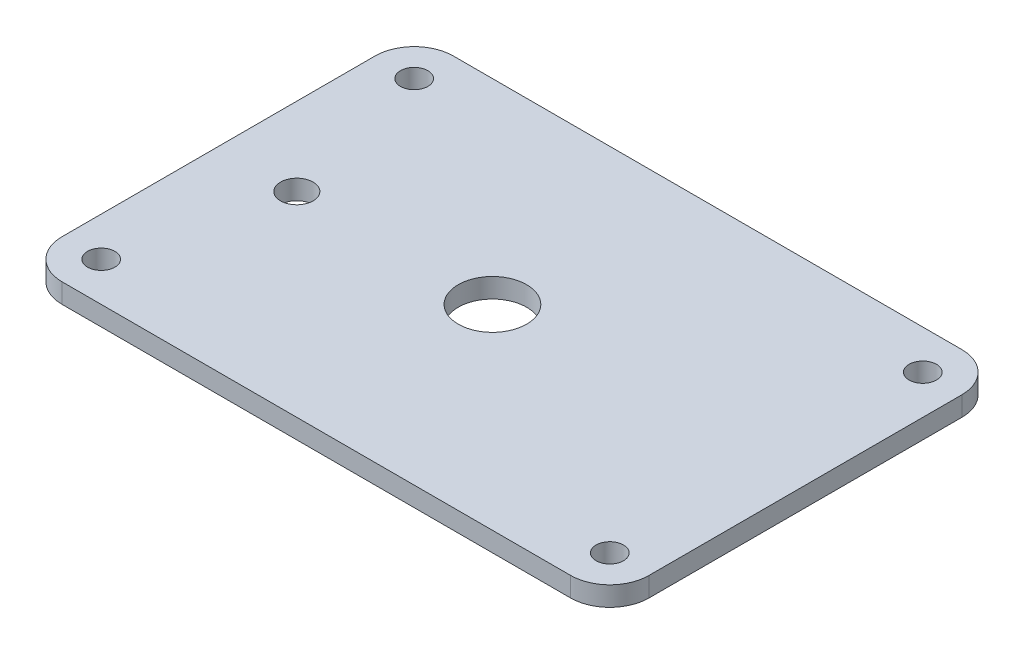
from build123d import *

# Parameters (mm, degrees)
SKETCH1_R         = 5.25
SKETCH1_R_2       = 2.5
EXTRUDE1_DEPTH    = 3
M5_TAPPED_HOLE1_D = 4.2


with BuildPart() as part:
    # Sketch1 → Extrude1 (new body)
    with BuildSketch(Plane(origin=(0, 0, 0), x_dir=(1, 0, 0), z_dir=(0, 1, 0))):
        with BuildLine():
            Line((6, 0), (84, 0))
            ThreePointArc((84, 0), (88.242640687, 1.757359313), (90, 6))
            Line((90, 6), (90, 54))
            ThreePointArc((90, 54), (88.242640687, 58.242640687), (84, 60))
            Line((84, 60), (6, 60))
            ThreePointArc((6, 60), (1.757359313, 58.242640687), (0, 54))
            Line((0, 54), (0, 6))
            ThreePointArc((0, 6), (1.757359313, 1.757359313), (6, 0))
        make_face()
        with Locations(Location((42, 30, 0), (0, 0, 270))):
            Circle(SKETCH1_R, mode=Mode.SUBTRACT)
        with Locations(Location((12, 30, 0), (0, 0, 270))):
            Circle(SKETCH1_R_2, mode=Mode.SUBTRACT)
    extrude(amount=EXTRUDE1_DEPTH)

    # M5 Tapped Hole1 (through all)
    with Locations(Plane(origin=(6, 3, -54), x_dir=(0, 0, 1), z_dir=(0, 1, 0))):
        with Locations((0, 0), (48, 0), (48, 78), (0, 78)):
            Hole(M5_TAPPED_HOLE1_D / 2)


solid = part.part
